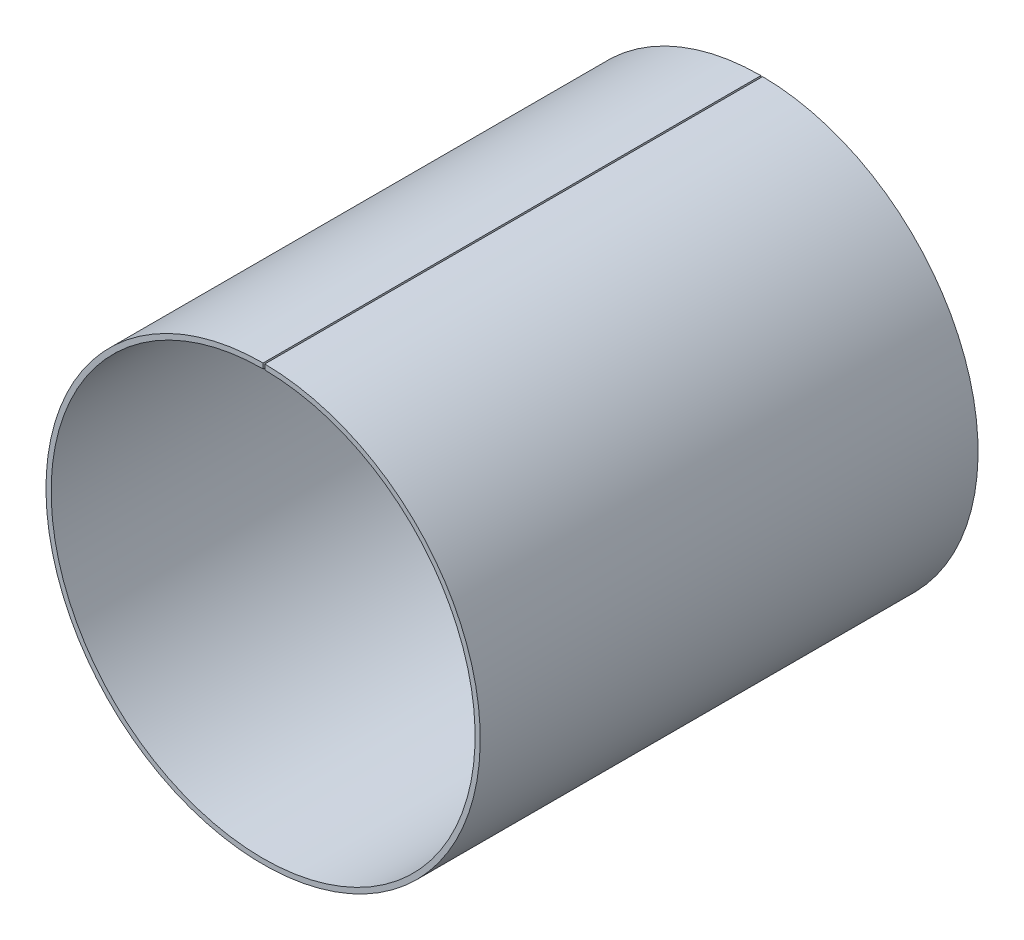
ISO-10303-21;
HEADER;
FILE_DESCRIPTION(('STEP AP214'),'2;1');
FILE_NAME('part.step','',(''),(''),'','','');
FILE_SCHEMA(('AUTOMOTIVE_DESIGN { 1 0 10303 214 1 1 1 1 }'));
ENDSEC;
DATA;
#1=APPLICATION_CONTEXT('core data for automotive mechanical design processes');
#2=APPLICATION_PROTOCOL_DEFINITION('international standard','automotive_design',2000,#1);
#3=PRODUCT_CONTEXT('',#1,'mechanical');
#4=PRODUCT('Part','Part','',(#3));
#5=PRODUCT_RELATED_PRODUCT_CATEGORY('part','',(#4));
#6=PRODUCT_DEFINITION_FORMATION('','',#4);
#7=PRODUCT_DEFINITION_CONTEXT('part definition',#1,'design');
#8=PRODUCT_DEFINITION('design','',#6,#7);
#9=PRODUCT_DEFINITION_SHAPE('','',#8);
#10=(LENGTH_UNIT() NAMED_UNIT(*) SI_UNIT(.MILLI.,.METRE.));
#11=(NAMED_UNIT(*) PLANE_ANGLE_UNIT() SI_UNIT($,.RADIAN.));
#12=(NAMED_UNIT(*) SI_UNIT($,.STERADIAN.) SOLID_ANGLE_UNIT());
#13=UNCERTAINTY_MEASURE_WITH_UNIT(LENGTH_MEASURE(1.E-05),#10,'distance_accuracy_value','');
#14=(GEOMETRIC_REPRESENTATION_CONTEXT(3) GLOBAL_UNCERTAINTY_ASSIGNED_CONTEXT((#13)) GLOBAL_UNIT_ASSIGNED_CONTEXT((#10,
#11,#12)) REPRESENTATION_CONTEXT('',''));
#15=CARTESIAN_POINT('',(0.,0.,0.));
#16=DIRECTION('',(0.,0.,1.));
#17=DIRECTION('',(1.,0.,0.));
#18=AXIS2_PLACEMENT_3D('',#15,#16,#17);
#19=CARTESIAN_POINT('',(0.,0.,290.));
#20=DIRECTION('',(0.,0.,-1.));
#21=DIRECTION('',(-1.,0.,0.));
#22=AXIS2_PLACEMENT_3D('',#19,#20,#21);
#23=CYLINDRICAL_SURFACE('',#22,126.5);
#24=CARTESIAN_POINT('',(0.,0.,0.));
#25=DIRECTION('',(0.,0.,1.));
#26=DIRECTION('',(1.,0.,0.));
#27=AXIS2_PLACEMENT_3D('',#24,#25,#26);
#28=CIRCLE('',#27,126.5);
#29=CARTESIAN_POINT('',(0.,126.5,0.));
#30=VERTEX_POINT('',#29);
#31=CARTESIAN_POINT('',(0.999992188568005,126.49604743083,0.));
#32=VERTEX_POINT('',#31);
#33=EDGE_CURVE('E99',#30,#32,#28,.T.);
#34=ORIENTED_EDGE('',*,*,#33,.T.);
#35=DIRECTION('',(0.,0.,-1.));
#36=VECTOR('',#35,1.);
#37=CARTESIAN_POINT('',(0.999992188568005,126.49604743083,290.));
#38=LINE('',#37,#36);
#39=CARTESIAN_POINT('',(0.999992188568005,126.49604743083,290.));
#40=VERTEX_POINT('',#39);
#41=EDGE_CURVE('E11',#40,#32,#38,.T.);
#42=ORIENTED_EDGE('',*,*,#41,.F.);
#43=CARTESIAN_POINT('',(0.,0.,290.));
#44=DIRECTION('',(0.,0.,1.));
#45=DIRECTION('',(1.,0.,0.));
#46=AXIS2_PLACEMENT_3D('',#43,#44,#45);
#47=CIRCLE('',#46,126.5);
#48=CARTESIAN_POINT('',(0.,126.5,290.));
#49=VERTEX_POINT('',#48);
#50=EDGE_CURVE('E76',#49,#40,#47,.T.);
#51=ORIENTED_EDGE('',*,*,#50,.F.);
#52=DIRECTION('',(0.,0.,-1.));
#53=VECTOR('',#52,1.);
#54=CARTESIAN_POINT('',(0.,126.5,290.));
#55=LINE('',#54,#53);
#56=EDGE_CURVE('E52',#49,#30,#55,.T.);
#57=ORIENTED_EDGE('',*,*,#56,.T.);
#58=EDGE_LOOP('',(#34,#42,#51,#57));
#59=FACE_BOUND('',#58,.T.);
#60=ADVANCED_FACE('F36',(#59),#23,.T.);
#61=CARTESIAN_POINT('',(0.976276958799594,123.496141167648,290.));
#62=DIRECTION('',(-0.999968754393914,0.00790507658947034,0.));
#63=DIRECTION('',(-0.00790507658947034,-0.999968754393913,0.));
#64=AXIS2_PLACEMENT_3D('',#61,#62,#63);
#65=PLANE('',#64);
#66=DIRECTION('',(0.00790507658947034,0.999968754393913,0.));
#67=VECTOR('',#66,1.);
#68=CARTESIAN_POINT('',(0.976276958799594,123.496141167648,0.));
#69=LINE('',#68,#67);
#70=CARTESIAN_POINT('',(0.976276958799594,123.496141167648,0.));
#71=VERTEX_POINT('',#70);
#72=EDGE_CURVE('E85',#71,#32,#69,.T.);
#73=ORIENTED_EDGE('',*,*,#72,.F.);
#74=DIRECTION('',(0.,0.,-1.));
#75=VECTOR('',#74,1.);
#76=CARTESIAN_POINT('',(0.976276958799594,123.496141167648,290.));
#77=LINE('',#76,#75);
#78=CARTESIAN_POINT('',(0.976276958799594,123.496141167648,290.));
#79=VERTEX_POINT('',#78);
#80=EDGE_CURVE('E44',#79,#71,#77,.T.);
#81=ORIENTED_EDGE('',*,*,#80,.F.);
#82=DIRECTION('',(0.00790507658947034,0.999968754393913,0.));
#83=VECTOR('',#82,1.);
#84=CARTESIAN_POINT('',(0.976276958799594,123.496141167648,290.));
#85=LINE('',#84,#83);
#86=EDGE_CURVE('E83',#79,#40,#85,.T.);
#87=ORIENTED_EDGE('',*,*,#86,.T.);
#88=ORIENTED_EDGE('',*,*,#41,.T.);
#89=EDGE_LOOP('',(#73,#81,#87,#88));
#90=FACE_BOUND('',#89,.T.);
#91=ADVANCED_FACE('F82',(#90),#65,.T.);
#92=CARTESIAN_POINT('',(0.,0.,290.));
#93=DIRECTION('',(0.,0.,-1.));
#94=DIRECTION('',(-1.,0.,0.));
#95=AXIS2_PLACEMENT_3D('',#92,#93,#94);
#96=CYLINDRICAL_SURFACE('',#95,123.5);
#97=CARTESIAN_POINT('',(0.,0.,0.));
#98=DIRECTION('',(0.,0.,1.));
#99=DIRECTION('',(1.,0.,0.));
#100=AXIS2_PLACEMENT_3D('',#97,#98,#99);
#101=CIRCLE('',#100,123.5);
#102=CARTESIAN_POINT('',(0.,123.5,0.));
#103=VERTEX_POINT('',#102);
#104=EDGE_CURVE('E102',#103,#71,#101,.T.);
#105=ORIENTED_EDGE('',*,*,#104,.F.);
#106=DIRECTION('',(0.,0.,-1.));
#107=VECTOR('',#106,1.);
#108=CARTESIAN_POINT('',(0.,123.5,290.));
#109=LINE('',#108,#107);
#110=CARTESIAN_POINT('',(0.,123.5,290.));
#111=VERTEX_POINT('',#110);
#112=EDGE_CURVE('E65',#111,#103,#109,.T.);
#113=ORIENTED_EDGE('',*,*,#112,.F.);
#114=CARTESIAN_POINT('',(0.,0.,290.));
#115=DIRECTION('',(0.,0.,1.));
#116=DIRECTION('',(1.,0.,0.));
#117=AXIS2_PLACEMENT_3D('',#114,#115,#116);
#118=CIRCLE('',#117,123.5);
#119=EDGE_CURVE('E91',#111,#79,#118,.T.);
#120=ORIENTED_EDGE('',*,*,#119,.T.);
#121=ORIENTED_EDGE('',*,*,#80,.T.);
#122=EDGE_LOOP('',(#105,#113,#120,#121));
#123=FACE_BOUND('',#122,.T.);
#124=ADVANCED_FACE('F93',(#123),#96,.F.);
#125=CARTESIAN_POINT('',(0.,126.5,290.));
#126=DIRECTION('',(1.,0.,0.));
#127=DIRECTION('',(0.,1.,0.));
#128=AXIS2_PLACEMENT_3D('',#125,#126,#127);
#129=PLANE('',#128);
#130=DIRECTION('',(0.,-1.,0.));
#131=VECTOR('',#130,1.);
#132=CARTESIAN_POINT('',(0.,126.5,0.));
#133=LINE('',#132,#131);
#134=EDGE_CURVE('E104',#30,#103,#133,.T.);
#135=ORIENTED_EDGE('',*,*,#134,.F.);
#136=ORIENTED_EDGE('',*,*,#56,.F.);
#137=DIRECTION('',(0.,-1.,0.));
#138=VECTOR('',#137,1.);
#139=CARTESIAN_POINT('',(0.,126.5,290.));
#140=LINE('',#139,#138);
#141=EDGE_CURVE('E94',#49,#111,#140,.T.);
#142=ORIENTED_EDGE('',*,*,#141,.T.);
#143=ORIENTED_EDGE('',*,*,#112,.T.);
#144=EDGE_LOOP('',(#135,#136,#142,#143));
#145=FACE_BOUND('',#144,.T.);
#146=ADVANCED_FACE('F110',(#145),#129,.T.);
#147=CARTESIAN_POINT('',(0.,0.,290.));
#148=DIRECTION('',(0.,0.,1.));
#149=DIRECTION('',(1.,0.,0.));
#150=AXIS2_PLACEMENT_3D('',#147,#148,#149);
#151=PLANE('',#150);
#152=ORIENTED_EDGE('',*,*,#50,.T.);
#153=ORIENTED_EDGE('',*,*,#86,.F.);
#154=ORIENTED_EDGE('',*,*,#119,.F.);
#155=ORIENTED_EDGE('',*,*,#141,.F.);
#156=EDGE_LOOP('',(#152,#153,#154,#155));
#157=FACE_BOUND('',#156,.T.);
#158=ADVANCED_FACE('F90',(#157),#151,.T.);
#159=CARTESIAN_POINT('',(0.,0.,0.));
#160=DIRECTION('',(0.,0.,1.));
#161=DIRECTION('',(1.,0.,0.));
#162=AXIS2_PLACEMENT_3D('',#159,#160,#161);
#163=PLANE('',#162);
#164=ORIENTED_EDGE('',*,*,#33,.F.);
#165=ORIENTED_EDGE('',*,*,#134,.T.);
#166=ORIENTED_EDGE('',*,*,#104,.T.);
#167=ORIENTED_EDGE('',*,*,#72,.T.);
#168=EDGE_LOOP('',(#164,#165,#166,#167));
#169=FACE_BOUND('',#168,.T.);
#170=ADVANCED_FACE('F109',(#169),#163,.F.);
#171=CLOSED_SHELL('',(#60,#91,#124,#146,#158,#170));
#172=MANIFOLD_SOLID_BREP('B2',#171);
#173=ADVANCED_BREP_SHAPE_REPRESENTATION('',(#18,#172),#14);
#174=SHAPE_DEFINITION_REPRESENTATION(#9,#173);
ENDSEC;
END-ISO-10303-21;
